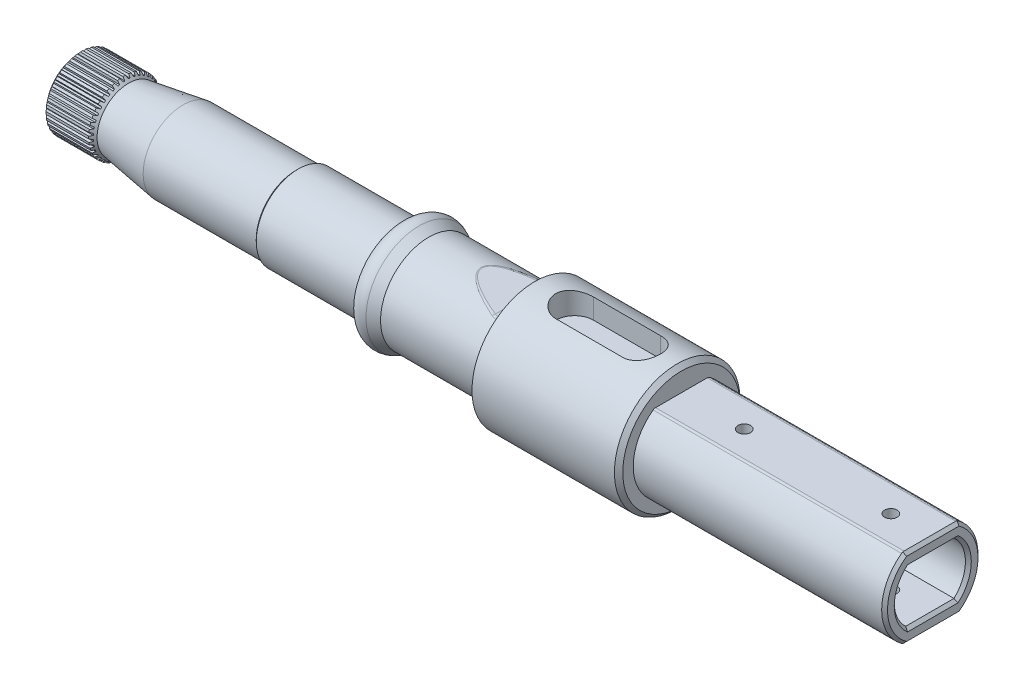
from build123d import *

# Parameters (mm, degrees)
ENL_V_MAT_EXTRU_1_DEPTH      = 206.936883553
ENL_V_MAT_EXTRU_3_DEPTH      = 97
CHANFREIN4_SIZE              = 0.7
CONG_2_R                     = 1
ESQUISSE5_W                  = 35
ESQUISSE5_H                  = 7
ENL_V_MAT_EXTRU_4_DEPTH      = 207.012742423
R_P_TITION_CIRCULAIRE1_COUNT = 2
CHANFREIN5_SIZE              = 1
ESQUISSE7_R                  = 1.5
ENL_V_MAT_EXTRU_5_DEPTH      = 207.012742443
ENL_V_MAT_EXTRU_6_DEPTH      = 12
R_P_TITION_CIRCULAIRE2_COUNT = 40
ESQUISSE9_R                  = 4.5
ENL_V_MAT_EXTRU_7_DEPTH      = 40


with BuildPart() as part:
    # Esquisse1 → Base-R_volution (revolve)
    with BuildSketch(Plane.XY, mode=Mode.PRIVATE) as base_r_volution_sk:
        with BuildLine():
            Line((0, 7.5), (0.80832938, 8.5))
            Line((0.80832938, 8.5), (11, 8.5))
            Line((11, 8.5), (12, 7.5))
            Line((12, 7.5), (25, 9.5))
            Line((25, 9.5), (52, 9.5))
            Line((52, 9.5), (52.5, 10))
            Line((52.5, 10), (76.535898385, 10))
            Line((76.535898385, 10), (77.401923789, 11.5))
            ThreePointArc((77.401923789, 11.5), (79.146977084, 12.876169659), (81.360155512, 12.673944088))
            Line((81.360155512, 12.673944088), (83.668024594, 11.5))
            Line((83.668024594, 11.5), (204, 11.5))
            Line((204, 11.5), (204, 0))
            Line((204, 0), (0, 0))
            Line((0, 0), (0, 7.5))
        make_face()
    revolve(base_r_volution_sk.sketch.rotate(Axis((-8, 0, 0), (1, 0, 0)), 90), axis=Axis((-8, 0, 0), (1, 0, 0)))

    # Esquisse2 → Enl_v. mat.-Extru.1 (cut, through all)
    with BuildSketch(Plane.XY.offset(12)):
        with BuildLine():
            Line((208, 9.5), (106.40749138, 9.5))
            ThreePointArc((106.40749138, 9.5), (106.002098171, 9.520595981), (105.600879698, 9.582171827))
            Line((105.600879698, 9.582171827), (89, 13))
            Line((89, 13), (208, 13))
            Line((208, 13), (208, 9.5))
        make_face()
        with BuildLine():
            Line((105.600879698, -9.582171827), (89, -13))
            Line((89, -13), (208, -13))
            Line((208, -13), (208, -9.5))
            Line((208, -9.5), (106.40749138, -9.5))
            ThreePointArc((106.40749138, -9.5), (106.002098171, -9.520595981), (105.600879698, -9.582171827))
        make_face()
    extrude(amount=-ENL_V_MAT_EXTRU_1_DEPTH, mode=Mode.SUBTRACT)

    # Esquisse4 → Enl_v. mat.-Extru.3 (cut)
    with BuildSketch(Plane(origin=(204, 0, 0), x_dir=(0, 0, -1), z_dir=(1, 0, 0))):
        with BuildLine():
            Line((-5.760859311, 6.25), (5.760859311, 6.25))
            ThreePointArc((5.760859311, 6.25), (8.5, 0), (5.760859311, -6.25))
            Line((5.760859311, -6.25), (-5.760859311, -6.25))
            ThreePointArc((-5.760859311, -6.25), (-8.5, 0), (-5.760859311, 6.25))
        make_face()
    extrude(amount=-ENL_V_MAT_EXTRU_3_DEPTH, mode=Mode.SUBTRACT)

    # Chanfrein4
    chanfrein4_edges = [part.edges().sort_by_distance(p)[0] for p in [
        (204, -5.372219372, 10.168050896),
        (204, 0, -11.5),
        (204, 5.372219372, 10.168050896),
        (204, 9.5, 0),
        (204, -9.5, 0),
        (204, -6.25, 0),
        (204, 0, -8.5),
        (204, 6.25, 0),
        (204, 0, 8.5),
    ]]
    chamfer(chanfrein4_edges, length=CHANFREIN4_SIZE)

    # Cong_2
    cong_2_edges = [part.edges().sort_by_distance(p)[0] for p in [
        (96.285714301, -11.499999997, 0.000267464),
        (96.285714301, 11.499999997, 0.000267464),
    ]]
    fillet(cong_2_edges, radius=CONG_2_R)

    # Esquisse5 → Boss.-R_vol.1 (revolve)
    with BuildSketch(Plane.XY, mode=Mode.PRIVATE) as boss_r_vol_1_sk:
        with Locations((126.5, 11.5)):
            Rectangle(ESQUISSE5_W, ESQUISSE5_H)
    revolve(boss_r_vol_1_sk.sketch.rotate(Axis((208.957139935, 0, 0), (-1, 0, 0)), 88.013097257), axis=Axis((208.957139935, 0, 0), (-1, 0, 0)))

    # Esquisse6 → Enl_v. mat.-Extru.4 (cut, through all)
    with BuildSketch(Plane(origin=(0, 9.5, 0), x_dir=(-1, 0, 0), z_dir=(0, 1, 0))):
        with BuildLine():
            Line((-134.5, -4.5), (-118.5, -4.5))
            ThreePointArc((-118.5, -4.5), (-114, 0), (-118.5, 4.5))
            Line((-118.5, 4.5), (-134.5, 4.5))
            ThreePointArc((-134.5, 4.5), (-139, 0), (-134.5, -4.5))
        make_face()
    enl_v_mat_extru_4 = extrude(amount=ENL_V_MAT_EXTRU_4_DEPTH, mode=Mode.SUBTRACT)

    # R_p_tition circulaire1: Enl_v. mat.-Extru.4 ×2 about axis
    r_p_tition_circulaire1_axis = Axis((0, 0, 0), (1, 0, 0))
    for i in range(1, R_P_TITION_CIRCULAIRE1_COUNT):
        add(enl_v_mat_extru_4.rotate(r_p_tition_circulaire1_axis, i * 360 / R_P_TITION_CIRCULAIRE1_COUNT), mode=Mode.SUBTRACT)

    # Chanfrein5
    chanfrein5_edges = [part.edges().sort_by_distance(p)[0] for p in [
        (144, -0.520065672, 14.990981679),
    ]]
    chamfer(chanfrein5_edges, length=CHANFREIN5_SIZE)

    # Esquisse7 → Enl_v. mat.-Extru.5 (cut, through all)
    with BuildSketch(Plane(origin=(0, 9.5, 0), x_dir=(-1, 0, 0), z_dir=(0, 1, 0))):
        with Locations((-194, 0)):
            Circle(ESQUISSE7_R)
        with Locations((-159, 0)):
            Circle(ESQUISSE7_R)
    extrude(amount=-ENL_V_MAT_EXTRU_5_DEPTH, mode=Mode.SUBTRACT)

    # Esquisse8 → Enl_v. mat.-Extru.6 (cut)
    with BuildSketch(Plane.ZY):
        Polygon((-0.204984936, 8.871804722), (-0.42545112, 7.945612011), (-0.822754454, 7.91434356), (-1.185394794, 8.794644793), align=None)
    enl_v_mat_extru_6 = extrude(amount=-ENL_V_MAT_EXTRU_6_DEPTH, mode=Mode.SUBTRACT)

    # R_p_tition circulaire2: Enl_v. mat.-Extru.6 ×40 about axis
    r_p_tition_circulaire2_axis = Axis((-8, 0, 0), (1, 0, 0))
    for i in range(1, R_P_TITION_CIRCULAIRE2_COUNT):
        add(enl_v_mat_extru_6.rotate(r_p_tition_circulaire2_axis, i * 360 / R_P_TITION_CIRCULAIRE2_COUNT), mode=Mode.SUBTRACT)

    # Esquisse9 → Enl_v. mat.-Extru.7 (cut)
    with BuildSketch(Plane.ZY):
        Circle(ESQUISSE9_R)
    extrude(amount=-ENL_V_MAT_EXTRU_7_DEPTH, mode=Mode.SUBTRACT)


solid = part.part
